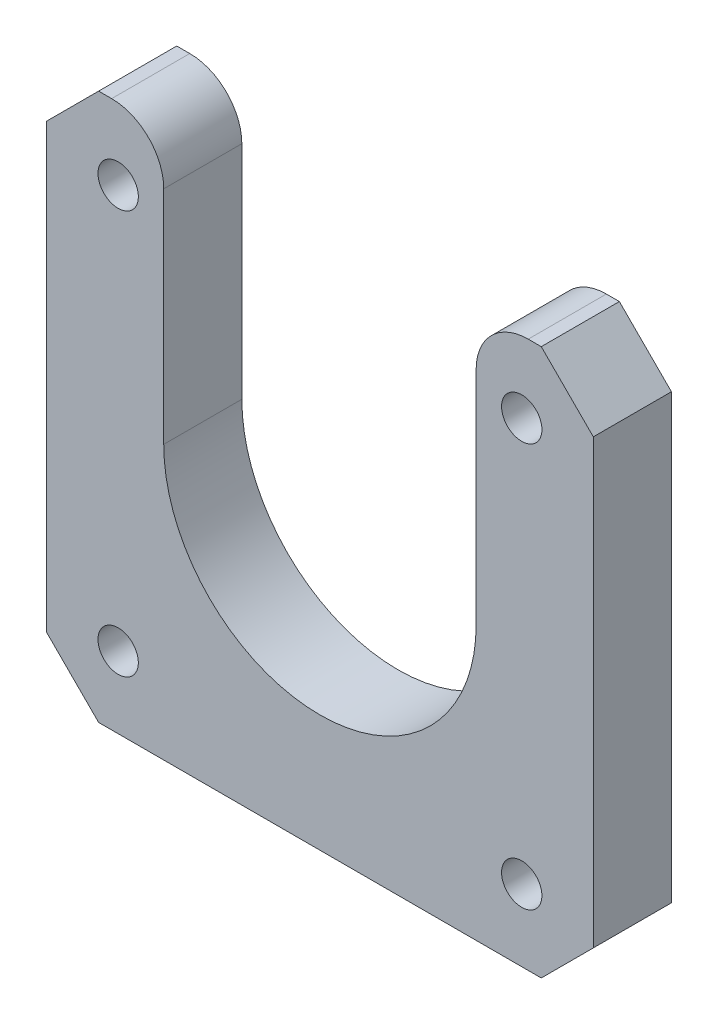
from build123d import *

# Parameters (mm, degrees)
SKETCH_1_R      = 1.55
EXTRUDE_1_DEPTH = 6
CHAMFER_1_SIZE  = 4
FILLET_1_R      = 4


with BuildPart() as part:
    # Sketch 1 → Extrude 1 (new body)
    with BuildSketch(Plane.XY):
        with BuildLine():
            Line((-21, -21), (21, -21))
            Line((21, -21), (21, 21))
            Line((21, 21), (12, 21))
            Line((12, 21), (12, 0))
            ThreePointArc((12, 0), (0, -12), (-12, 0))
            Line((-12, 0), (-12, 21))
            Line((-12, 21), (-21, 21))
            Line((-21, 21), (-21, -21))
        make_face()
        with Locations((15.5, 15.5)):
            Circle(SKETCH_1_R, mode=Mode.SUBTRACT)
        with Locations(Location((-15.5, 15.5, 0), (0, 0, 180))):
            Circle(SKETCH_1_R, mode=Mode.SUBTRACT)
        with Locations((-15.5, -15.5)):
            Circle(SKETCH_1_R, mode=Mode.SUBTRACT)
        with Locations(Location((15.5, -15.5, 0), (0, 0, 180))):
            Circle(SKETCH_1_R, mode=Mode.SUBTRACT)
    extrude(amount=EXTRUDE_1_DEPTH)

    # Chamfer 1
    chamfer_1_edges = [part.edges().sort_by_distance(p)[0] for p in [
        (21, 21, 3),
        (21, -21, 3),
        (-21, -21, 3),
        (-21, 21, 3),
    ]]
    chamfer(chamfer_1_edges, length=CHAMFER_1_SIZE)

    # Fillet 1
    fillet_1_edges = [part.edges().sort_by_distance(p)[0] for p in [
        (-12, 21, 3),
        (12, 21, 3),
    ]]
    fillet(fillet_1_edges, radius=FILLET_1_R)


solid = part.part
